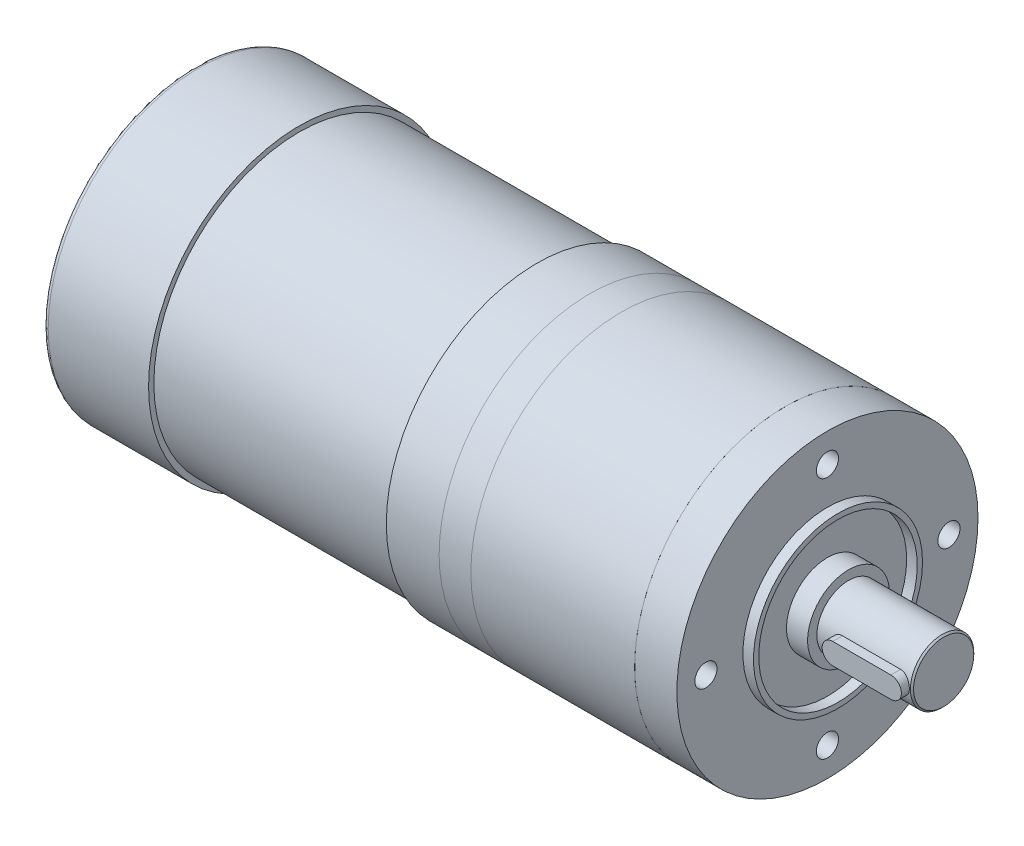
from build123d import *

# Parameters (mm, degrees)
SKETCH_1_R                  = 28.5
EXTRUDE_1_DEPTH             = 8
SKETCH_2_R                  = 28.5
EXTRUDE_2_DEPTH             = 31
SKETCH_3_R                  = 28.5
EXTRUDE_3_DEPTH             = 6
SKETCH_4_R                  = 28.5
EXTRUDE_4_DEPTH             = 10
SKETCH_5_R                  = 27.5
EXTRUDE_5_DEPTH             = 45
SKETCH_6_R                  = 28.5
EXTRUDE_6_DEPTH             = 20
FILLET_1_R                  = 1
SKETCH_7_R                  = 16
SKETCH_7_R_2                = 15
EXTRUDE_7_DEPTH             = 2
SKETCH_8_R                  = 7.75
EXTRUDE_8_DEPTH             = 4
SKETCH_9_R                  = 6
EXTRUDE_9_DEPTH             = 18
HOLE_WIZARD_M5_1_AT_2_COUNT = 2
HOLE_WIZARD_M5_1_AT_2_PITCH = 32.526911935
HOLE_WIZARD_M5_1_AT_3_COUNT = 2
HOLE_WIZARD_M5_1_AT_3_PITCH = 46
HOLE_WIZARD_M5_1_AT_4_COUNT = 2
HOLE_WIZARD_M5_1_AT_4_PITCH = 32.526911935
CUT_EXTRUDE_1_DEPTH         = 2.5
EXTRUDE_10_DEPTH            = 4
CHAMFER_1_SIZE              = 0.3


with BuildPart() as part:
    # Sketch 1 → Extrude 1 (new body)
    with BuildSketch(Plane(origin=(0, 0, 0), x_dir=(0, 0, -1), z_dir=(1, 0, 0))):
        Circle(SKETCH_1_R)
    extrude(amount=-EXTRUDE_1_DEPTH)

    # Sketch 7 → Extrude 7 (add)
    with BuildSketch(Plane(origin=(0, 0, 0), x_dir=(0, 0, -1), z_dir=(1, 0, 0))):
        Circle(SKETCH_7_R)
        Circle(SKETCH_7_R_2, mode=Mode.SUBTRACT)
    extrude(amount=EXTRUDE_7_DEPTH)

    # Sketch 8 → Extrude 8 (add)
    with BuildSketch(Plane(origin=(0, 0, 0), x_dir=(0, 0, -1), z_dir=(1, 0, 0))):
        Circle(SKETCH_8_R)
    extrude(amount=EXTRUDE_8_DEPTH)

    # Sketch 9 → Extrude 9 (add)
    with BuildSketch(Plane(origin=(4, 0, 0), x_dir=(0, 0, -1), z_dir=(1, 0, 0))):
        Circle(SKETCH_9_R)
    extrude(amount=EXTRUDE_9_DEPTH)


with BuildPart() as body_2:
    # Sketch 2 → Extrude 2 (new body)
    with BuildSketch(Plane.ZY.offset(8)):
        Circle(SKETCH_2_R)
    extrude(amount=EXTRUDE_2_DEPTH)


with BuildPart() as body_3:
    # Sketch 3 → Extrude 3 (new body)
    with BuildSketch(Plane.ZY.offset(39)):
        Circle(SKETCH_3_R)
    extrude(amount=EXTRUDE_3_DEPTH)


with BuildPart() as body_4:
    # Sketch 4 → Extrude 4 (new body)
    with BuildSketch(Plane.ZY.offset(45)):
        Circle(SKETCH_4_R)
    extrude(amount=EXTRUDE_4_DEPTH)

    # Sketch 5 → Extrude 5 (add)
    with BuildSketch(Plane.ZY.offset(55)):
        with Locations(Location((0, 0, 0), (0, 0, 180))):
            Circle(SKETCH_5_R)
    extrude(amount=EXTRUDE_5_DEPTH)

    # Sketch 6 → Extrude 6 (add)
    with BuildSketch(Plane.ZY.offset(100)):
        Circle(SKETCH_6_R)
    extrude(amount=EXTRUDE_6_DEPTH)

    # Fillet 1
    fillet_1_edges = [body_4.edges().sort_by_distance(p)[0] for p in [
        (-120, 0, -28.5),
    ]]
    fillet(fillet_1_edges, radius=FILLET_1_R)


with BuildPart() as hole_wizard_m5_1_tool:
    # Sketch 11 → Hole Wizard M5 _1 (revolve)
    with BuildSketch(Plane(origin=(0, 23, 0), x_dir=(0, 0, -1), z_dir=(0, 1, 0))):
        Polygon((0, 0), (0, 15.2618073), (2.1, 14), (2.1, 0), align=None)
    hole_wizard_m5_1 = revolve(axis=Axis((6.35, 23, 0), (-1, 0, 0)))


with BuildPart() as part_1:
    add(part.part)

    # Hole Wizard M5 _1: cut by hole_wizard_m5_1_tool
    add(hole_wizard_m5_1_tool.part, mode=Mode.SUBTRACT)


with BuildPart() as body_2_1:
    add(body_2.part)

    # Hole Wizard M5 _1: cut by hole_wizard_m5_1_tool
    add(hole_wizard_m5_1_tool.part, mode=Mode.SUBTRACT)


with BuildPart() as hole_wizard_m5_1_at_2_tool:
    # Hole Wizard M5 _1 at 2: Hole Wizard M5 _1 ×2
    with Locations(*[Vector(0, -0.7071067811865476, -0.7071067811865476) * (i * HOLE_WIZARD_M5_1_AT_2_PITCH) for i in range(1, HOLE_WIZARD_M5_1_AT_2_COUNT)]):
        add(hole_wizard_m5_1)


with BuildPart() as part_2:
    add(part_1.part)

    # Hole Wizard M5 _1 at 2: cut by hole_wizard_m5_1_at_2_tool
    add(hole_wizard_m5_1_at_2_tool.part, mode=Mode.SUBTRACT)


with BuildPart() as body_2_2:
    add(body_2_1.part)

    # Hole Wizard M5 _1 at 2: cut by hole_wizard_m5_1_at_2_tool
    add(hole_wizard_m5_1_at_2_tool.part, mode=Mode.SUBTRACT)


with BuildPart() as hole_wizard_m5_1_at_3_tool:
    # Hole Wizard M5 _1 at 3: Hole Wizard M5 _1 ×2
    with Locations(*[(0, -i * HOLE_WIZARD_M5_1_AT_3_PITCH, 0) for i in range(1, HOLE_WIZARD_M5_1_AT_3_COUNT)]):
        add(hole_wizard_m5_1)


with BuildPart() as part_3:
    add(part_2.part)

    # Hole Wizard M5 _1 at 3: cut by hole_wizard_m5_1_at_3_tool
    add(hole_wizard_m5_1_at_3_tool.part, mode=Mode.SUBTRACT)


with BuildPart() as body_2_3:
    add(body_2_2.part)

    # Hole Wizard M5 _1 at 3: cut by hole_wizard_m5_1_at_3_tool
    add(hole_wizard_m5_1_at_3_tool.part, mode=Mode.SUBTRACT)


with BuildPart() as hole_wizard_m5_1_at_4_tool:
    # Hole Wizard M5 _1 at 4: Hole Wizard M5 _1 ×2
    with Locations(*[Vector(0, -0.7071067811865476, 0.7071067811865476) * (i * HOLE_WIZARD_M5_1_AT_4_PITCH) for i in range(1, HOLE_WIZARD_M5_1_AT_4_COUNT)]):
        add(hole_wizard_m5_1)


with BuildPart() as part_4:
    add(part_3.part)

    # Hole Wizard M5 _1 at 4: cut by hole_wizard_m5_1_at_4_tool
    add(hole_wizard_m5_1_at_4_tool.part, mode=Mode.SUBTRACT)

    # Sketch 12 → Cut-Extrude 1 (cut)
    with BuildSketch(Plane.XY.offset(6)):
        with BuildLine():
            Line((8.5, 2), (19.5, 2))
            ThreePointArc((19.5, 2), (21.5, 0), (19.5, -2))
            Line((19.5, -2), (8.5, -2))
            ThreePointArc((8.5, -2), (6.5, 0), (8.5, 2))
        make_face()
    extrude(amount=-CUT_EXTRUDE_1_DEPTH, mode=Mode.SUBTRACT)

    # Chamfer 1
    chamfer_1_edges = [part_4.edges().sort_by_distance(p)[0] for p in [
        (22, 0, 6),
    ]]
    chamfer(chamfer_1_edges, length=CHAMFER_1_SIZE)


with BuildPart() as body_2_4:
    add(body_2_3.part)

    # Hole Wizard M5 _1 at 4: cut by hole_wizard_m5_1_at_4_tool
    add(hole_wizard_m5_1_at_4_tool.part, mode=Mode.SUBTRACT)


with BuildPart() as body_5:
    # Sketch 13 → Extrude 10 (new body)
    with BuildSketch(Plane.XY.offset(3.5)):
        with BuildLine():
            Line((8.5, 2), (19.5, 2))
            ThreePointArc((19.5, 2), (21.5, 0), (19.5, -2))
            Line((19.5, -2), (8.5, -2))
            ThreePointArc((8.5, -2), (6.5, 0), (8.5, 2))
        make_face()
    extrude(amount=EXTRUDE_10_DEPTH)


solid = Compound([body_3.part, body_4.part, part_4.part, body_2_4.part, body_5.part])
